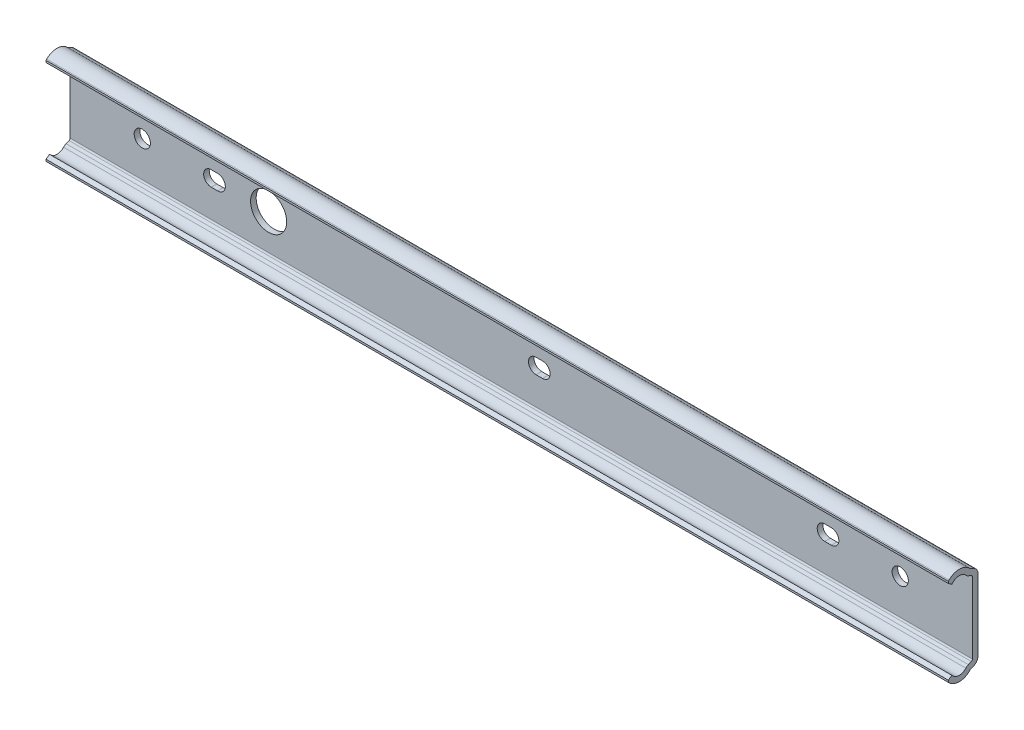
ISO-10303-21;
HEADER;
FILE_DESCRIPTION(('STEP AP214'),'2;1');
FILE_NAME('part.step','',(''),(''),'','','');
FILE_SCHEMA(('AUTOMOTIVE_DESIGN { 1 0 10303 214 1 1 1 1 }'));
ENDSEC;
DATA;
#1=APPLICATION_CONTEXT('core data for automotive mechanical design processes');
#2=APPLICATION_PROTOCOL_DEFINITION('international standard','automotive_design',2000,#1);
#3=PRODUCT_CONTEXT('',#1,'mechanical');
#4=PRODUCT('Part','Part','',(#3));
#5=PRODUCT_RELATED_PRODUCT_CATEGORY('part','',(#4));
#6=PRODUCT_DEFINITION_FORMATION('','',#4);
#7=PRODUCT_DEFINITION_CONTEXT('part definition',#1,'design');
#8=PRODUCT_DEFINITION('design','',#6,#7);
#9=PRODUCT_DEFINITION_SHAPE('','',#8);
#10=(LENGTH_UNIT() NAMED_UNIT(*) SI_UNIT(.MILLI.,.METRE.));
#11=(NAMED_UNIT(*) PLANE_ANGLE_UNIT() SI_UNIT($,.RADIAN.));
#12=(NAMED_UNIT(*) SI_UNIT($,.STERADIAN.) SOLID_ANGLE_UNIT());
#13=UNCERTAINTY_MEASURE_WITH_UNIT(LENGTH_MEASURE(1.E-05),#10,'distance_accuracy_value','');
#14=(GEOMETRIC_REPRESENTATION_CONTEXT(3) GLOBAL_UNCERTAINTY_ASSIGNED_CONTEXT((#13)) GLOBAL_UNIT_ASSIGNED_CONTEXT((#10,
#11,#12)) REPRESENTATION_CONTEXT('',''));
#15=CARTESIAN_POINT('',(0.,0.,0.));
#16=DIRECTION('',(0.,0.,1.));
#17=DIRECTION('',(1.,0.,0.));
#18=AXIS2_PLACEMENT_3D('',#15,#16,#17);
#19=CARTESIAN_POINT('',(-20.,-9.85313472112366,0.));
#20=DIRECTION('',(0.,0.,1.));
#21=DIRECTION('',(1.,0.,0.));
#22=AXIS2_PLACEMENT_3D('',#19,#20,#21);
#23=PLANE('',#22);
#24=DIRECTION('',(-1.,0.,0.));
#25=VECTOR('',#24,1.);
#26=CARTESIAN_POINT('',(-20.,2.09999999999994,0.));
#27=LINE('',#26,#25);
#28=CARTESIAN_POINT('',(110.9,2.1,0.));
#29=VERTEX_POINT('',#28);
#30=CARTESIAN_POINT('',(109.1,2.1,0.));
#31=VERTEX_POINT('',#30);
#32=EDGE_CURVE('E324',#29,#31,#27,.T.);
#33=ORIENTED_EDGE('',*,*,#32,.T.);
#34=CARTESIAN_POINT('',(109.1,0.,0.));
#35=DIRECTION('',(0.,0.,1.));
#36=DIRECTION('',(1.,0.,0.));
#37=AXIS2_PLACEMENT_3D('',#34,#35,#36);
#38=CIRCLE('',#37,2.1);
#39=CARTESIAN_POINT('',(109.1,-2.1,0.));
#40=VERTEX_POINT('',#39);
#41=EDGE_CURVE('E327',#31,#40,#38,.T.);
#42=ORIENTED_EDGE('',*,*,#41,.T.);
#43=DIRECTION('',(1.,0.,0.));
#44=VECTOR('',#43,1.);
#45=CARTESIAN_POINT('',(-20.,-2.10000000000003,0.));
#46=LINE('',#45,#44);
#47=CARTESIAN_POINT('',(110.9,-2.1,0.));
#48=VERTEX_POINT('',#47);
#49=EDGE_CURVE('E321',#40,#48,#46,.T.);
#50=ORIENTED_EDGE('',*,*,#49,.T.);
#51=CARTESIAN_POINT('',(110.9,0.,0.));
#52=DIRECTION('',(0.,0.,1.));
#53=DIRECTION('',(1.,0.,0.));
#54=AXIS2_PLACEMENT_3D('',#51,#52,#53);
#55=CIRCLE('',#54,2.1);
#56=EDGE_CURVE('E265',#48,#29,#55,.T.);
#57=ORIENTED_EDGE('',*,*,#56,.T.);
#58=EDGE_LOOP('',(#33,#42,#50,#57));
#59=FACE_BOUND('',#58,.T.);
#60=DIRECTION('',(-1.,0.,0.));
#61=VECTOR('',#60,1.);
#62=CARTESIAN_POINT('',(-20.,2.0999999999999,0.));
#63=LINE('',#62,#61);
#64=CARTESIAN_POINT('',(190.9,2.1,0.));
#65=VERTEX_POINT('',#64);
#66=CARTESIAN_POINT('',(189.1,2.1,0.));
#67=VERTEX_POINT('',#66);
#68=EDGE_CURVE('E315',#65,#67,#63,.T.);
#69=ORIENTED_EDGE('',*,*,#68,.T.);
#70=CARTESIAN_POINT('',(189.1,0.,0.));
#71=DIRECTION('',(0.,0.,1.));
#72=DIRECTION('',(1.,0.,0.));
#73=AXIS2_PLACEMENT_3D('',#70,#71,#72);
#74=CIRCLE('',#73,2.1);
#75=CARTESIAN_POINT('',(189.1,-2.1,0.));
#76=VERTEX_POINT('',#75);
#77=EDGE_CURVE('E318',#67,#76,#74,.T.);
#78=ORIENTED_EDGE('',*,*,#77,.T.);
#79=DIRECTION('',(1.,0.,0.));
#80=VECTOR('',#79,1.);
#81=CARTESIAN_POINT('',(-20.,-2.10000000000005,0.));
#82=LINE('',#81,#80);
#83=CARTESIAN_POINT('',(190.9,-2.1,0.));
#84=VERTEX_POINT('',#83);
#85=EDGE_CURVE('E289',#76,#84,#82,.T.);
#86=ORIENTED_EDGE('',*,*,#85,.T.);
#87=CARTESIAN_POINT('',(190.9,0.,0.));
#88=DIRECTION('',(0.,0.,1.));
#89=DIRECTION('',(1.,0.,0.));
#90=AXIS2_PLACEMENT_3D('',#87,#88,#89);
#91=CIRCLE('',#90,2.1);
#92=EDGE_CURVE('E312',#84,#65,#91,.T.);
#93=ORIENTED_EDGE('',*,*,#92,.T.);
#94=EDGE_LOOP('',(#69,#78,#86,#93));
#95=FACE_BOUND('',#94,.T.);
#96=DIRECTION('',(1.,0.,0.));
#97=VECTOR('',#96,1.);
#98=CARTESIAN_POINT('',(-20.,-9.85313472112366,0.));
#99=LINE('',#98,#97);
#100=CARTESIAN_POINT('',(-20.,-9.85313472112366,0.));
#101=VERTEX_POINT('',#100);
#102=CARTESIAN_POINT('',(230.,-9.85313472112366,0.));
#103=VERTEX_POINT('',#102);
#104=EDGE_CURVE('E515',#101,#103,#99,.T.);
#105=ORIENTED_EDGE('',*,*,#104,.F.);
#106=DIRECTION('',(0.,-1.,0.));
#107=VECTOR('',#106,1.);
#108=CARTESIAN_POINT('',(-20.,-9.85313472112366,0.));
#109=LINE('',#108,#107);
#110=CARTESIAN_POINT('',(-20.,9.85313427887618,0.));
#111=VERTEX_POINT('',#110);
#112=EDGE_CURVE('E433',#111,#101,#109,.T.);
#113=ORIENTED_EDGE('',*,*,#112,.F.);
#114=DIRECTION('',(1.,0.,0.));
#115=VECTOR('',#114,1.);
#116=CARTESIAN_POINT('',(-20.,9.85313427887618,0.));
#117=LINE('',#116,#115);
#118=CARTESIAN_POINT('',(230.,9.85313427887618,0.));
#119=VERTEX_POINT('',#118);
#120=EDGE_CURVE('E518',#111,#119,#117,.T.);
#121=ORIENTED_EDGE('',*,*,#120,.T.);
#122=DIRECTION('',(0.,-1.,0.));
#123=VECTOR('',#122,1.);
#124=CARTESIAN_POINT('',(230.,-9.85313472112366,0.));
#125=LINE('',#124,#123);
#126=EDGE_CURVE('E380',#119,#103,#125,.T.);
#127=ORIENTED_EDGE('',*,*,#126,.T.);
#128=EDGE_LOOP('',(#105,#113,#121,#127));
#129=FACE_BOUND('',#128,.T.);
#130=CARTESIAN_POINT('',(35.,0.,0.));
#131=DIRECTION('',(0.,0.,-1.));
#132=DIRECTION('',(-1.,0.,0.));
#133=AXIS2_PLACEMENT_3D('',#130,#131,#132);
#134=CIRCLE('',#133,5.);
#135=CARTESIAN_POINT('',(30.,0.,0.));
#136=VERTEX_POINT('',#135);
#137=EDGE_CURVE('E330',#136,#136,#134,.T.);
#138=ORIENTED_EDGE('',*,*,#137,.F.);
#139=EDGE_LOOP('',(#138));
#140=FACE_BOUND('',#139,.T.);
#141=DIRECTION('',(-1.,0.,0.));
#142=VECTOR('',#141,1.);
#143=CARTESIAN_POINT('',(20.9,-2.1,0.));
#144=LINE('',#143,#142);
#145=CARTESIAN_POINT('',(20.9,-2.1,0.));
#146=VERTEX_POINT('',#145);
#147=CARTESIAN_POINT('',(19.1,-2.1,0.));
#148=VERTEX_POINT('',#147);
#149=EDGE_CURVE('E335',#146,#148,#144,.T.);
#150=ORIENTED_EDGE('',*,*,#149,.F.);
#151=CARTESIAN_POINT('',(20.9,0.,0.));
#152=DIRECTION('',(0.,0.,-1.));
#153=DIRECTION('',(-1.,0.,0.));
#154=AXIS2_PLACEMENT_3D('',#151,#152,#153);
#155=CIRCLE('',#154,2.1);
#156=CARTESIAN_POINT('',(20.9,2.1,0.));
#157=VERTEX_POINT('',#156);
#158=EDGE_CURVE('E333',#157,#146,#155,.T.);
#159=ORIENTED_EDGE('',*,*,#158,.F.);
#160=DIRECTION('',(1.,0.,0.));
#161=VECTOR('',#160,1.);
#162=CARTESIAN_POINT('',(20.9,2.1,0.));
#163=LINE('',#162,#161);
#164=CARTESIAN_POINT('',(19.1,2.1,0.));
#165=VERTEX_POINT('',#164);
#166=EDGE_CURVE('E341',#165,#157,#163,.T.);
#167=ORIENTED_EDGE('',*,*,#166,.F.);
#168=CARTESIAN_POINT('',(19.1,0.,0.));
#169=DIRECTION('',(0.,0.,-1.));
#170=DIRECTION('',(-1.,0.,0.));
#171=AXIS2_PLACEMENT_3D('',#168,#169,#170);
#172=CIRCLE('',#171,2.1);
#173=EDGE_CURVE('E338',#148,#165,#172,.T.);
#174=ORIENTED_EDGE('',*,*,#173,.F.);
#175=EDGE_LOOP('',(#150,#159,#167,#174));
#176=FACE_BOUND('',#175,.T.);
#177=CARTESIAN_POINT('',(0.,0.,0.));
#178=DIRECTION('',(0.,0.,-1.));
#179=DIRECTION('',(-1.,0.,0.));
#180=AXIS2_PLACEMENT_3D('',#177,#178,#179);
#181=CIRCLE('',#180,2.24999999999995);
#182=CARTESIAN_POINT('',(-2.24999999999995,0.,0.));
#183=VERTEX_POINT('',#182);
#184=EDGE_CURVE('E347',#183,#183,#181,.T.);
#185=ORIENTED_EDGE('',*,*,#184,.F.);
#186=EDGE_LOOP('',(#185));
#187=FACE_BOUND('',#186,.T.);
#188=CARTESIAN_POINT('',(210.,0.,0.));
#189=DIRECTION('',(0.,0.,-1.));
#190=DIRECTION('',(-1.,0.,0.));
#191=AXIS2_PLACEMENT_3D('',#188,#189,#190);
#192=CIRCLE('',#191,2.25);
#193=CARTESIAN_POINT('',(207.75,0.,0.));
#194=VERTEX_POINT('',#193);
#195=EDGE_CURVE('E357',#194,#194,#192,.T.);
#196=ORIENTED_EDGE('',*,*,#195,.F.);
#197=EDGE_LOOP('',(#196));
#198=FACE_BOUND('',#197,.T.);
#199=ADVANCED_FACE('F14',(#59,#95,#129,#140,#176,#187,#198),#23,.F.);
#200=CARTESIAN_POINT('',(-20.,-9.85313472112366,1.54999999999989));
#201=DIRECTION('',(0.,0.,-1.));
#202=DIRECTION('',(-1.,0.,0.));
#203=AXIS2_PLACEMENT_3D('',#200,#201,#202);
#204=PLANE('',#203);
#205=DIRECTION('',(1.,0.,0.));
#206=VECTOR('',#205,1.);
#207=CARTESIAN_POINT('',(109.1,-2.1,1.54999999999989));
#208=LINE('',#207,#206);
#209=CARTESIAN_POINT('',(109.1,-2.1,1.54999999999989));
#210=VERTEX_POINT('',#209);
#211=CARTESIAN_POINT('',(110.9,-2.1,1.54999999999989));
#212=VERTEX_POINT('',#211);
#213=EDGE_CURVE('E272',#210,#212,#208,.T.);
#214=ORIENTED_EDGE('',*,*,#213,.F.);
#215=CARTESIAN_POINT('',(109.1,0.,1.54999999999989));
#216=DIRECTION('',(0.,0.,1.));
#217=DIRECTION('',(1.,0.,0.));
#218=AXIS2_PLACEMENT_3D('',#215,#216,#217);
#219=CIRCLE('',#218,2.1);
#220=CARTESIAN_POINT('',(109.1,2.1,1.54999999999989));
#221=VERTEX_POINT('',#220);
#222=EDGE_CURVE('E277',#221,#210,#219,.T.);
#223=ORIENTED_EDGE('',*,*,#222,.F.);
#224=DIRECTION('',(-1.,0.,0.));
#225=VECTOR('',#224,1.);
#226=CARTESIAN_POINT('',(109.1,2.1,1.54999999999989));
#227=LINE('',#226,#225);
#228=CARTESIAN_POINT('',(110.9,2.1,1.54999999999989));
#229=VERTEX_POINT('',#228);
#230=EDGE_CURVE('E282',#229,#221,#227,.T.);
#231=ORIENTED_EDGE('',*,*,#230,.F.);
#232=CARTESIAN_POINT('',(110.9,0.,1.54999999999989));
#233=DIRECTION('',(0.,0.,1.));
#234=DIRECTION('',(1.,0.,0.));
#235=AXIS2_PLACEMENT_3D('',#232,#233,#234);
#236=CIRCLE('',#235,2.1);
#237=EDGE_CURVE('E262',#212,#229,#236,.T.);
#238=ORIENTED_EDGE('',*,*,#237,.F.);
#239=EDGE_LOOP('',(#214,#223,#231,#238));
#240=FACE_BOUND('',#239,.T.);
#241=DIRECTION('',(1.,0.,0.));
#242=VECTOR('',#241,1.);
#243=CARTESIAN_POINT('',(189.1,-2.1,1.54999999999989));
#244=LINE('',#243,#242);
#245=CARTESIAN_POINT('',(189.1,-2.1,1.54999999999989));
#246=VERTEX_POINT('',#245);
#247=CARTESIAN_POINT('',(190.9,-2.1,1.54999999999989));
#248=VERTEX_POINT('',#247);
#249=EDGE_CURVE('E294',#246,#248,#244,.T.);
#250=ORIENTED_EDGE('',*,*,#249,.F.);
#251=CARTESIAN_POINT('',(189.1,0.,1.54999999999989));
#252=DIRECTION('',(0.,0.,1.));
#253=DIRECTION('',(1.,0.,0.));
#254=AXIS2_PLACEMENT_3D('',#251,#252,#253);
#255=CIRCLE('',#254,2.1);
#256=CARTESIAN_POINT('',(189.1,2.1,1.54999999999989));
#257=VERTEX_POINT('',#256);
#258=EDGE_CURVE('E292',#257,#246,#255,.T.);
#259=ORIENTED_EDGE('',*,*,#258,.F.);
#260=DIRECTION('',(-1.,0.,0.));
#261=VECTOR('',#260,1.);
#262=CARTESIAN_POINT('',(189.1,2.1,1.54999999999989));
#263=LINE('',#262,#261);
#264=CARTESIAN_POINT('',(190.9,2.1,1.54999999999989));
#265=VERTEX_POINT('',#264);
#266=EDGE_CURVE('E299',#265,#257,#263,.T.);
#267=ORIENTED_EDGE('',*,*,#266,.F.);
#268=CARTESIAN_POINT('',(190.9,0.,1.54999999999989));
#269=DIRECTION('',(0.,0.,1.));
#270=DIRECTION('',(1.,0.,0.));
#271=AXIS2_PLACEMENT_3D('',#268,#269,#270);
#272=CIRCLE('',#271,2.1);
#273=EDGE_CURVE('E296',#248,#265,#272,.T.);
#274=ORIENTED_EDGE('',*,*,#273,.F.);
#275=EDGE_LOOP('',(#250,#259,#267,#274));
#276=FACE_BOUND('',#275,.T.);
#277=CARTESIAN_POINT('',(35.,0.,1.54999999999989));
#278=DIRECTION('',(0.,0.,-1.));
#279=DIRECTION('',(-1.,0.,0.));
#280=AXIS2_PLACEMENT_3D('',#277,#278,#279);
#281=CIRCLE('',#280,5.);
#282=CARTESIAN_POINT('',(30.,0.,1.54999999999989));
#283=VERTEX_POINT('',#282);
#284=EDGE_CURVE('E18',#283,#283,#281,.T.);
#285=ORIENTED_EDGE('',*,*,#284,.T.);
#286=EDGE_LOOP('',(#285));
#287=FACE_BOUND('',#286,.T.);
#288=DIRECTION('',(1.,0.,0.));
#289=VECTOR('',#288,1.);
#290=CARTESIAN_POINT('',(-20.,2.1,1.54999999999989));
#291=LINE('',#290,#289);
#292=CARTESIAN_POINT('',(19.1,2.1,1.54999999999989));
#293=VERTEX_POINT('',#292);
#294=CARTESIAN_POINT('',(20.9,2.1,1.54999999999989));
#295=VERTEX_POINT('',#294);
#296=EDGE_CURVE('E23',#293,#295,#291,.T.);
#297=ORIENTED_EDGE('',*,*,#296,.T.);
#298=CARTESIAN_POINT('',(20.9,0.,1.54999999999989));
#299=DIRECTION('',(0.,0.,-1.));
#300=DIRECTION('',(-1.,0.,0.));
#301=AXIS2_PLACEMENT_3D('',#298,#299,#300);
#302=CIRCLE('',#301,2.1);
#303=CARTESIAN_POINT('',(20.9,-2.1,1.54999999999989));
#304=VERTEX_POINT('',#303);
#305=EDGE_CURVE('E9',#295,#304,#302,.T.);
#306=ORIENTED_EDGE('',*,*,#305,.T.);
#307=DIRECTION('',(-1.,0.,0.));
#308=VECTOR('',#307,1.);
#309=CARTESIAN_POINT('',(-20.,-2.1,1.54999999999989));
#310=LINE('',#309,#308);
#311=CARTESIAN_POINT('',(19.1,-2.1,1.54999999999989));
#312=VERTEX_POINT('',#311);
#313=EDGE_CURVE('E545',#304,#312,#310,.T.);
#314=ORIENTED_EDGE('',*,*,#313,.T.);
#315=CARTESIAN_POINT('',(19.1,0.,1.54999999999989));
#316=DIRECTION('',(0.,0.,-1.));
#317=DIRECTION('',(-1.,0.,0.));
#318=AXIS2_PLACEMENT_3D('',#315,#316,#317);
#319=CIRCLE('',#318,2.1);
#320=EDGE_CURVE('E552',#312,#293,#319,.T.);
#321=ORIENTED_EDGE('',*,*,#320,.T.);
#322=EDGE_LOOP('',(#297,#306,#314,#321));
#323=FACE_BOUND('',#322,.T.);
#324=CARTESIAN_POINT('',(0.,0.,1.54999999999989));
#325=DIRECTION('',(0.,0.,-1.));
#326=DIRECTION('',(-1.,0.,0.));
#327=AXIS2_PLACEMENT_3D('',#324,#325,#326);
#328=CIRCLE('',#327,2.24999999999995);
#329=CARTESIAN_POINT('',(-2.24999999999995,0.,1.54999999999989));
#330=VERTEX_POINT('',#329);
#331=EDGE_CURVE('E356',#330,#330,#328,.T.);
#332=ORIENTED_EDGE('',*,*,#331,.T.);
#333=EDGE_LOOP('',(#332));
#334=FACE_BOUND('',#333,.T.);
#335=CARTESIAN_POINT('',(210.,0.,1.54999999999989));
#336=DIRECTION('',(0.,0.,-1.));
#337=DIRECTION('',(-1.,0.,0.));
#338=AXIS2_PLACEMENT_3D('',#335,#336,#337);
#339=CIRCLE('',#338,2.25);
#340=CARTESIAN_POINT('',(207.75,0.,1.54999999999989));
#341=VERTEX_POINT('',#340);
#342=EDGE_CURVE('E360',#341,#341,#339,.T.);
#343=ORIENTED_EDGE('',*,*,#342,.T.);
#344=EDGE_LOOP('',(#343));
#345=FACE_BOUND('',#344,.T.);
#346=DIRECTION('',(1.,0.,0.));
#347=VECTOR('',#346,1.);
#348=CARTESIAN_POINT('',(-20.,9.85313427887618,1.54999999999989));
#349=LINE('',#348,#347);
#350=CARTESIAN_POINT('',(-20.,9.85313427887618,1.54999999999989));
#351=VERTEX_POINT('',#350);
#352=CARTESIAN_POINT('',(230.,9.85313427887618,1.54999999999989));
#353=VERTEX_POINT('',#352);
#354=EDGE_CURVE('E476',#351,#353,#349,.T.);
#355=ORIENTED_EDGE('',*,*,#354,.F.);
#356=DIRECTION('',(0.,1.,0.));
#357=VECTOR('',#356,1.);
#358=CARTESIAN_POINT('',(-20.,-9.85313472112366,1.54999999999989));
#359=LINE('',#358,#357);
#360=CARTESIAN_POINT('',(-20.,-9.85313472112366,1.54999999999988));
#361=VERTEX_POINT('',#360);
#362=EDGE_CURVE('E459',#361,#351,#359,.T.);
#363=ORIENTED_EDGE('',*,*,#362,.F.);
#364=DIRECTION('',(1.,0.,0.));
#365=VECTOR('',#364,1.);
#366=CARTESIAN_POINT('',(-20.,-9.85313472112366,1.54999999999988));
#367=LINE('',#366,#365);
#368=CARTESIAN_POINT('',(230.,-9.85313472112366,1.54999999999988));
#369=VERTEX_POINT('',#368);
#370=EDGE_CURVE('E479',#361,#369,#367,.T.);
#371=ORIENTED_EDGE('',*,*,#370,.T.);
#372=DIRECTION('',(0.,1.,0.));
#373=VECTOR('',#372,1.);
#374=CARTESIAN_POINT('',(230.,-9.85313472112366,1.54999999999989));
#375=LINE('',#374,#373);
#376=EDGE_CURVE('E406',#369,#353,#375,.T.);
#377=ORIENTED_EDGE('',*,*,#376,.T.);
#378=EDGE_LOOP('',(#355,#363,#371,#377));
#379=FACE_BOUND('',#378,.T.);
#380=ADVANCED_FACE('F279',(#240,#276,#287,#323,#334,#345,#379),#204,.F.);
#381=CARTESIAN_POINT('',(-20.,9.47,5.19000063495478));
#382=DIRECTION('',(-1.,0.,0.));
#383=DIRECTION('',(0.,0.,1.));
#384=AXIS2_PLACEMENT_3D('',#381,#382,#383);
#385=PLANE('',#384);
#386=ORIENTED_EDGE('',*,*,#362,.T.);
#387=CARTESIAN_POINT('',(-20.,9.85313427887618,2.05000034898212));
#388=DIRECTION('',(1.,0.,0.));
#389=DIRECTION('',(0.,0.,1.));
#390=AXIS2_PLACEMENT_3D('',#387,#388,#389);
#391=CIRCLE('',#390,0.500000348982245);
#392=CARTESIAN_POINT('',(-20.,10.3133869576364,1.85463448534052));
#393=VERTEX_POINT('',#392);
#394=EDGE_CURVE('E461',#351,#393,#391,.T.);
#395=ORIENTED_EDGE('',*,*,#394,.T.);
#396=DIRECTION('',(0.,0.39073096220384,0.920504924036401));
#397=VECTOR('',#396,1.);
#398=CARTESIAN_POINT('',(-20.,10.6566650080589,2.66334729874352));
#399=LINE('',#398,#397);
#400=CARTESIAN_POINT('',(-20.,10.6566650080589,2.66334729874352));
#401=VERTEX_POINT('',#400);
#402=EDGE_CURVE('E463',#393,#401,#399,.T.);
#403=ORIENTED_EDGE('',*,*,#402,.T.);
#404=CARTESIAN_POINT('',(-20.,12.5437002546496,1.86234835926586));
#405=DIRECTION('',(-1.,0.,0.));
#406=DIRECTION('',(0.,0.,1.));
#407=AXIS2_PLACEMENT_3D('',#404,#405,#406);
#408=CIRCLE('',#407,2.05000032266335);
#409=CARTESIAN_POINT('',(-20.,11.152732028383,3.36823969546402));
#410=VERTEX_POINT('',#409);
#411=EDGE_CURVE('E465',#401,#410,#408,.T.);
#412=ORIENTED_EDGE('',*,*,#411,.T.);
#413=CARTESIAN_POINT('',(-20.,9.47,5.19000063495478));
#414=DIRECTION('',(1.,0.,0.));
#415=DIRECTION('',(0.,0.,1.));
#416=AXIS2_PLACEMENT_3D('',#413,#414,#415);
#417=CIRCLE('',#416,2.48);
#418=CARTESIAN_POINT('',(-20.,11.2236248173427,6.94362545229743));
#419=VERTEX_POINT('',#418);
#420=EDGE_CURVE('E414',#410,#419,#417,.T.);
#421=ORIENTED_EDGE('',*,*,#420,.T.);
#422=DIRECTION('',(0.,-0.707107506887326,0.707106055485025));
#423=VECTOR('',#422,1.);
#424=CARTESIAN_POINT('',(-20.,11.2236248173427,6.94362545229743));
#425=LINE('',#424,#423);
#426=CARTESIAN_POINT('',(-20.,10.9144130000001,7.2528366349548));
#427=VERTEX_POINT('',#426);
#428=EDGE_CURVE('E417',#419,#427,#425,.T.);
#429=ORIENTED_EDGE('',*,*,#428,.T.);
#430=DIRECTION('',(0.,0.573576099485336,0.819152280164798));
#431=VECTOR('',#430,1.);
#432=CARTESIAN_POINT('',(-20.,10.9144130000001,7.2528366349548));
#433=LINE('',#432,#431);
#434=CARTESIAN_POINT('',(-20.,11.59863,8.23000063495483));
#435=VERTEX_POINT('',#434);
#436=EDGE_CURVE('E419',#427,#435,#433,.T.);
#437=ORIENTED_EDGE('',*,*,#436,.T.);
#438=DIRECTION('',(0.,1.,-2.09219452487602E-13));
#439=VECTOR('',#438,1.);
#440=CARTESIAN_POINT('',(-20.,12.12928,8.23000063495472));
#441=LINE('',#440,#439);
#442=CARTESIAN_POINT('',(-20.,12.12928,8.23000063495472));
#443=VERTEX_POINT('',#442);
#444=EDGE_CURVE('E421',#435,#443,#441,.T.);
#445=ORIENTED_EDGE('',*,*,#444,.T.);
#446=DIRECTION('',(0.,0.707108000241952,-0.707105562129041));
#447=VECTOR('',#446,1.);
#448=CARTESIAN_POINT('',(-20.,12.3196403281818,8.03964096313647));
#449=LINE('',#448,#447);
#450=CARTESIAN_POINT('',(-20.,12.3196403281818,8.03964096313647));
#451=VERTEX_POINT('',#450);
#452=EDGE_CURVE('E423',#443,#451,#449,.T.);
#453=ORIENTED_EDGE('',*,*,#452,.T.);
#454=CARTESIAN_POINT('',(-20.,9.47,5.19000063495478));
#455=DIRECTION('',(-1.,0.,0.));
#456=DIRECTION('',(0.,0.,1.));
#457=AXIS2_PLACEMENT_3D('',#454,#455,#456);
#458=CIRCLE('',#457,4.02999999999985);
#459=CARTESIAN_POINT('',(-20.,12.2044395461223,2.22963910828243));
#460=VERTEX_POINT('',#459);
#461=EDGE_CURVE('E425',#451,#460,#458,.T.);
#462=ORIENTED_EDGE('',*,*,#461,.T.);
#463=CARTESIAN_POINT('',(-20.,12.5437002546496,1.86234835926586));
#464=DIRECTION('',(1.,0.,0.));
#465=DIRECTION('',(0.,0.,1.));
#466=AXIS2_PLACEMENT_3D('',#463,#464,#465);
#467=CIRCLE('',#466,0.500000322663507);
#468=CARTESIAN_POINT('',(-20.,12.0834476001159,2.05771421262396));
#469=VERTEX_POINT('',#468);
#470=EDGE_CURVE('E427',#460,#469,#467,.T.);
#471=ORIENTED_EDGE('',*,*,#470,.T.);
#472=DIRECTION('',(0.,-0.39073096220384,-0.920504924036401));
#473=VECTOR('',#472,1.);
#474=CARTESIAN_POINT('',(-20.,12.0834476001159,2.05771421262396));
#475=LINE('',#474,#473);
#476=CARTESIAN_POINT('',(-20.,11.7401695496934,1.24900139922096));
#477=VERTEX_POINT('',#476);
#478=EDGE_CURVE('E429',#469,#477,#475,.T.);
#479=ORIENTED_EDGE('',*,*,#478,.T.);
#480=CARTESIAN_POINT('',(-20.,9.85313427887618,2.05000034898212));
#481=DIRECTION('',(-1.,0.,0.));
#482=DIRECTION('',(0.,0.,1.));
#483=AXIS2_PLACEMENT_3D('',#480,#481,#482);
#484=CIRCLE('',#483,2.05000034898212);
#485=EDGE_CURVE('E431',#477,#111,#484,.T.);
#486=ORIENTED_EDGE('',*,*,#485,.T.);
#487=ORIENTED_EDGE('',*,*,#112,.T.);
#488=CARTESIAN_POINT('',(-20.,-9.85313472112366,2.05000034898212));
#489=DIRECTION('',(-1.,0.,0.));
#490=DIRECTION('',(0.,0.,-1.));
#491=AXIS2_PLACEMENT_3D('',#488,#489,#490);
#492=CIRCLE('',#491,2.05000034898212);
#493=CARTESIAN_POINT('',(-20.,-11.7401699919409,1.24900139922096));
#494=VERTEX_POINT('',#493);
#495=EDGE_CURVE('E435',#101,#494,#492,.T.);
#496=ORIENTED_EDGE('',*,*,#495,.T.);
#497=DIRECTION('',(0.,-0.39073096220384,0.920504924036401));
#498=VECTOR('',#497,1.);
#499=CARTESIAN_POINT('',(-20.,-12.0834480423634,2.05771421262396));
#500=LINE('',#499,#498);
#501=CARTESIAN_POINT('',(-20.,-12.0834480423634,2.05771421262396));
#502=VERTEX_POINT('',#501);
#503=EDGE_CURVE('E437',#494,#502,#500,.T.);
#504=ORIENTED_EDGE('',*,*,#503,.T.);
#505=CARTESIAN_POINT('',(-20.,-12.543700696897,1.86234835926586));
#506=DIRECTION('',(1.,0.,0.));
#507=DIRECTION('',(0.,0.,-1.));
#508=AXIS2_PLACEMENT_3D('',#505,#506,#507);
#509=CIRCLE('',#508,0.500000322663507);
#510=CARTESIAN_POINT('',(-20.,-12.2044399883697,2.22963910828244));
#511=VERTEX_POINT('',#510);
#512=EDGE_CURVE('E439',#502,#511,#509,.T.);
#513=ORIENTED_EDGE('',*,*,#512,.T.);
#514=CARTESIAN_POINT('',(-20.,-9.47000044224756,5.19000063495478));
#515=DIRECTION('',(-1.,0.,0.));
#516=DIRECTION('',(0.,0.,-1.));
#517=AXIS2_PLACEMENT_3D('',#514,#515,#516);
#518=CIRCLE('',#517,4.02999999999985);
#519=CARTESIAN_POINT('',(-20.,-12.3196407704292,8.03964096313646));
#520=VERTEX_POINT('',#519);
#521=EDGE_CURVE('E441',#511,#520,#518,.T.);
#522=ORIENTED_EDGE('',*,*,#521,.T.);
#523=DIRECTION('',(0.,0.707108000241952,0.707105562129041));
#524=VECTOR('',#523,1.);
#525=CARTESIAN_POINT('',(-20.,-12.3196407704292,8.03964096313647));
#526=LINE('',#525,#524);
#527=CARTESIAN_POINT('',(-20.,-12.1292804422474,8.23000063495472));
#528=VERTEX_POINT('',#527);
#529=EDGE_CURVE('E443',#520,#528,#526,.T.);
#530=ORIENTED_EDGE('',*,*,#529,.T.);
#531=DIRECTION('',(0.,1.,2.09219452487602E-13));
#532=VECTOR('',#531,1.);
#533=CARTESIAN_POINT('',(-20.,-12.1292804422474,8.23000063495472));
#534=LINE('',#533,#532);
#535=CARTESIAN_POINT('',(-20.,-11.5986304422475,8.23000063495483));
#536=VERTEX_POINT('',#535);
#537=EDGE_CURVE('E445',#528,#536,#534,.T.);
#538=ORIENTED_EDGE('',*,*,#537,.T.);
#539=DIRECTION('',(0.,0.573576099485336,-0.819152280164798));
#540=VECTOR('',#539,1.);
#541=CARTESIAN_POINT('',(-20.,-10.9144134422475,7.2528366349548));
#542=LINE('',#541,#540);
#543=CARTESIAN_POINT('',(-20.,-10.9144134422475,7.2528366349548));
#544=VERTEX_POINT('',#543);
#545=EDGE_CURVE('E447',#536,#544,#542,.T.);
#546=ORIENTED_EDGE('',*,*,#545,.T.);
#547=DIRECTION('',(0.,-0.707107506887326,-0.707106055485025));
#548=VECTOR('',#547,1.);
#549=CARTESIAN_POINT('',(-20.,-11.2236252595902,6.94362545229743));
#550=LINE('',#549,#548);
#551=CARTESIAN_POINT('',(-20.,-11.2236252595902,6.94362545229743));
#552=VERTEX_POINT('',#551);
#553=EDGE_CURVE('E449',#544,#552,#550,.T.);
#554=ORIENTED_EDGE('',*,*,#553,.T.);
#555=CARTESIAN_POINT('',(-20.,-9.47000044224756,5.19000063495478));
#556=DIRECTION('',(1.,0.,0.));
#557=DIRECTION('',(0.,0.,-1.));
#558=AXIS2_PLACEMENT_3D('',#555,#556,#557);
#559=CIRCLE('',#558,2.48);
#560=CARTESIAN_POINT('',(-20.,-11.1527324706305,3.36823969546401));
#561=VERTEX_POINT('',#560);
#562=EDGE_CURVE('E451',#552,#561,#559,.T.);
#563=ORIENTED_EDGE('',*,*,#562,.T.);
#564=CARTESIAN_POINT('',(-20.,-12.543700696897,1.86234835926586));
#565=DIRECTION('',(-1.,0.,0.));
#566=DIRECTION('',(0.,0.,-1.));
#567=AXIS2_PLACEMENT_3D('',#564,#565,#566);
#568=CIRCLE('',#567,2.05000032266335);
#569=CARTESIAN_POINT('',(-20.,-10.6566654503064,2.66334729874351));
#570=VERTEX_POINT('',#569);
#571=EDGE_CURVE('E453',#561,#570,#568,.T.);
#572=ORIENTED_EDGE('',*,*,#571,.T.);
#573=DIRECTION('',(0.,0.39073096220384,-0.920504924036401));
#574=VECTOR('',#573,1.);
#575=CARTESIAN_POINT('',(-20.,-10.6566654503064,2.66334729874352));
#576=LINE('',#575,#574);
#577=CARTESIAN_POINT('',(-20.,-10.3133873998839,1.85463448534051));
#578=VERTEX_POINT('',#577);
#579=EDGE_CURVE('E455',#570,#578,#576,.T.);
#580=ORIENTED_EDGE('',*,*,#579,.T.);
#581=CARTESIAN_POINT('',(-20.,-9.85313472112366,2.05000034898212));
#582=DIRECTION('',(1.,0.,0.));
#583=DIRECTION('',(0.,0.,-1.));
#584=AXIS2_PLACEMENT_3D('',#581,#582,#583);
#585=CIRCLE('',#584,0.500000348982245);
#586=EDGE_CURVE('E457',#578,#361,#585,.T.);
#587=ORIENTED_EDGE('',*,*,#586,.T.);
#588=EDGE_LOOP('',(#386,#395,#403,#412,#421,#429,#437,#445,#453,#462,#471,#479,#486,#487,#496,
#504,#513,#522,#530,#538,#546,#554,#563,#572,#580,#587));
#589=FACE_BOUND('',#588,.T.);
#590=ADVANCED_FACE('F595',(#589),#385,.T.);
#591=CARTESIAN_POINT('',(-20.,9.47,5.19000063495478));
#592=DIRECTION('',(1.,0.,0.));
#593=DIRECTION('',(0.,0.,-1.));
#594=AXIS2_PLACEMENT_3D('',#591,#592,#593);
#595=CYLINDRICAL_SURFACE('',#594,2.48);
#596=CARTESIAN_POINT('',(230.,9.47,5.19000063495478));
#597=DIRECTION('',(1.,0.,0.));
#598=DIRECTION('',(0.,0.,1.));
#599=AXIS2_PLACEMENT_3D('',#596,#597,#598);
#600=CIRCLE('',#599,2.48);
#601=CARTESIAN_POINT('',(230.,11.152732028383,3.36823969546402));
#602=VERTEX_POINT('',#601);
#603=CARTESIAN_POINT('',(230.,11.2236248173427,6.94362545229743));
#604=VERTEX_POINT('',#603);
#605=EDGE_CURVE('E361',#602,#604,#600,.T.);
#606=ORIENTED_EDGE('',*,*,#605,.T.);
#607=DIRECTION('',(1.,0.,0.));
#608=VECTOR('',#607,1.);
#609=CARTESIAN_POINT('',(-20.,11.2236248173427,6.94362545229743));
#610=LINE('',#609,#608);
#611=EDGE_CURVE('E542',#419,#604,#610,.T.);
#612=ORIENTED_EDGE('',*,*,#611,.F.);
#613=ORIENTED_EDGE('',*,*,#420,.F.);
#614=DIRECTION('',(1.,0.,0.));
#615=VECTOR('',#614,1.);
#616=CARTESIAN_POINT('',(-20.,11.152732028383,3.36823969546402));
#617=LINE('',#616,#615);
#618=EDGE_CURVE('E467',#410,#602,#617,.T.);
#619=ORIENTED_EDGE('',*,*,#618,.T.);
#620=EDGE_LOOP('',(#606,#612,#613,#619));
#621=FACE_BOUND('',#620,.T.);
#622=ADVANCED_FACE('F16',(#621),#595,.F.);
#623=CARTESIAN_POINT('',(-20.,11.2236248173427,6.94362545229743));
#624=DIRECTION('',(0.,0.707106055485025,0.707107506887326));
#625=DIRECTION('',(0.,0.707107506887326,-0.707106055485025));
#626=AXIS2_PLACEMENT_3D('',#623,#624,#625);
#627=PLANE('',#626);
#628=DIRECTION('',(0.,-0.707107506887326,0.707106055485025));
#629=VECTOR('',#628,1.);
#630=CARTESIAN_POINT('',(230.,11.2236248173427,6.94362545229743));
#631=LINE('',#630,#629);
#632=CARTESIAN_POINT('',(230.,10.9144130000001,7.2528366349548));
#633=VERTEX_POINT('',#632);
#634=EDGE_CURVE('E364',#604,#633,#631,.T.);
#635=ORIENTED_EDGE('',*,*,#634,.T.);
#636=DIRECTION('',(1.,0.,0.));
#637=VECTOR('',#636,1.);
#638=CARTESIAN_POINT('',(-20.,10.9144130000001,7.2528366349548));
#639=LINE('',#638,#637);
#640=EDGE_CURVE('E539',#427,#633,#639,.T.);
#641=ORIENTED_EDGE('',*,*,#640,.F.);
#642=ORIENTED_EDGE('',*,*,#428,.F.);
#643=ORIENTED_EDGE('',*,*,#611,.T.);
#644=EDGE_LOOP('',(#635,#641,#642,#643));
#645=FACE_BOUND('',#644,.T.);
#646=ADVANCED_FACE('F628',(#645),#627,.F.);
#647=CARTESIAN_POINT('',(-20.,10.9144130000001,7.2528366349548));
#648=DIRECTION('',(0.,0.819152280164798,-0.573576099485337));
#649=DIRECTION('',(0.,-0.573576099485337,-0.819152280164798));
#650=AXIS2_PLACEMENT_3D('',#647,#648,#649);
#651=PLANE('',#650);
#652=DIRECTION('',(0.,0.573576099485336,0.819152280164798));
#653=VECTOR('',#652,1.);
#654=CARTESIAN_POINT('',(230.,10.9144130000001,7.2528366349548));
#655=LINE('',#654,#653);
#656=CARTESIAN_POINT('',(230.,11.59863,8.23000063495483));
#657=VERTEX_POINT('',#656);
#658=EDGE_CURVE('E366',#633,#657,#655,.T.);
#659=ORIENTED_EDGE('',*,*,#658,.T.);
#660=DIRECTION('',(1.,0.,0.));
#661=VECTOR('',#660,1.);
#662=CARTESIAN_POINT('',(-20.,11.59863,8.23000063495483));
#663=LINE('',#662,#661);
#664=EDGE_CURVE('E536',#435,#657,#663,.T.);
#665=ORIENTED_EDGE('',*,*,#664,.F.);
#666=ORIENTED_EDGE('',*,*,#436,.F.);
#667=ORIENTED_EDGE('',*,*,#640,.T.);
#668=EDGE_LOOP('',(#659,#665,#666,#667));
#669=FACE_BOUND('',#668,.T.);
#670=ADVANCED_FACE('F625',(#669),#651,.F.);
#671=CARTESIAN_POINT('',(-20.,12.12928,8.23000063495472));
#672=DIRECTION('',(0.,-2.09219452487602E-13,-1.));
#673=DIRECTION('',(0.,-1.,2.09219452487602E-13));
#674=AXIS2_PLACEMENT_3D('',#671,#672,#673);
#675=PLANE('',#674);
#676=DIRECTION('',(0.,1.,-2.09219452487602E-13));
#677=VECTOR('',#676,1.);
#678=CARTESIAN_POINT('',(230.,12.12928,8.23000063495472));
#679=LINE('',#678,#677);
#680=CARTESIAN_POINT('',(230.,12.12928,8.23000063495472));
#681=VERTEX_POINT('',#680);
#682=EDGE_CURVE('E368',#657,#681,#679,.T.);
#683=ORIENTED_EDGE('',*,*,#682,.T.);
#684=DIRECTION('',(1.,0.,0.));
#685=VECTOR('',#684,1.);
#686=CARTESIAN_POINT('',(-20.,12.12928,8.23000063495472));
#687=LINE('',#686,#685);
#688=EDGE_CURVE('E533',#443,#681,#687,.T.);
#689=ORIENTED_EDGE('',*,*,#688,.F.);
#690=ORIENTED_EDGE('',*,*,#444,.F.);
#691=ORIENTED_EDGE('',*,*,#664,.T.);
#692=EDGE_LOOP('',(#683,#689,#690,#691));
#693=FACE_BOUND('',#692,.T.);
#694=ADVANCED_FACE('F621',(#693),#675,.F.);
#695=CARTESIAN_POINT('',(-20.,12.3196403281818,8.03964096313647));
#696=DIRECTION('',(0.,-0.707105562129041,-0.707108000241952));
#697=DIRECTION('',(0.,-0.707108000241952,0.707105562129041));
#698=AXIS2_PLACEMENT_3D('',#695,#696,#697);
#699=PLANE('',#698);
#700=DIRECTION('',(0.,0.707108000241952,-0.707105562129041));
#701=VECTOR('',#700,1.);
#702=CARTESIAN_POINT('',(230.,12.3196403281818,8.03964096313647));
#703=LINE('',#702,#701);
#704=CARTESIAN_POINT('',(230.,12.3196403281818,8.03964096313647));
#705=VERTEX_POINT('',#704);
#706=EDGE_CURVE('E370',#681,#705,#703,.T.);
#707=ORIENTED_EDGE('',*,*,#706,.T.);
#708=DIRECTION('',(1.,0.,0.));
#709=VECTOR('',#708,1.);
#710=CARTESIAN_POINT('',(-20.,12.3196403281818,8.03964096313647));
#711=LINE('',#710,#709);
#712=EDGE_CURVE('E530',#451,#705,#711,.T.);
#713=ORIENTED_EDGE('',*,*,#712,.F.);
#714=ORIENTED_EDGE('',*,*,#452,.F.);
#715=ORIENTED_EDGE('',*,*,#688,.T.);
#716=EDGE_LOOP('',(#707,#713,#714,#715));
#717=FACE_BOUND('',#716,.T.);
#718=ADVANCED_FACE('F617',(#717),#699,.F.);
#719=CARTESIAN_POINT('',(-20.,9.47,5.19000063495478));
#720=DIRECTION('',(1.,0.,0.));
#721=DIRECTION('',(0.,0.,-1.));
#722=AXIS2_PLACEMENT_3D('',#719,#720,#721);
#723=CYLINDRICAL_SURFACE('',#722,4.02999999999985);
#724=DIRECTION('',(1.,0.,0.));
#725=VECTOR('',#724,1.);
#726=CARTESIAN_POINT('',(-20.,12.2044395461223,2.22963910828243));
#727=LINE('',#726,#725);
#728=CARTESIAN_POINT('',(230.,12.2044395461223,2.22963910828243));
#729=VERTEX_POINT('',#728);
#730=EDGE_CURVE('E527',#460,#729,#727,.T.);
#731=ORIENTED_EDGE('',*,*,#730,.F.);
#732=ORIENTED_EDGE('',*,*,#461,.F.);
#733=ORIENTED_EDGE('',*,*,#712,.T.);
#734=CARTESIAN_POINT('',(230.,9.47,5.19000063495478));
#735=DIRECTION('',(-1.,0.,0.));
#736=DIRECTION('',(0.,0.,1.));
#737=AXIS2_PLACEMENT_3D('',#734,#735,#736);
#738=CIRCLE('',#737,4.02999999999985);
#739=EDGE_CURVE('E372',#705,#729,#738,.T.);
#740=ORIENTED_EDGE('',*,*,#739,.T.);
#741=EDGE_LOOP('',(#731,#732,#733,#740));
#742=FACE_BOUND('',#741,.T.);
#743=ADVANCED_FACE('F613',(#742),#723,.T.);
#744=CARTESIAN_POINT('',(-20.,12.5437002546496,1.86234835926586));
#745=DIRECTION('',(1.,0.,0.));
#746=DIRECTION('',(0.,0.,-1.));
#747=AXIS2_PLACEMENT_3D('',#744,#745,#746);
#748=CYLINDRICAL_SURFACE('',#747,0.500000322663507);
#749=CARTESIAN_POINT('',(230.,12.5437002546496,1.86234835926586));
#750=DIRECTION('',(1.,0.,0.));
#751=DIRECTION('',(0.,0.,1.));
#752=AXIS2_PLACEMENT_3D('',#749,#750,#751);
#753=CIRCLE('',#752,0.500000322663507);
#754=CARTESIAN_POINT('',(230.,12.0834476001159,2.05771421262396));
#755=VERTEX_POINT('',#754);
#756=EDGE_CURVE('E374',#729,#755,#753,.T.);
#757=ORIENTED_EDGE('',*,*,#756,.T.);
#758=DIRECTION('',(1.,0.,0.));
#759=VECTOR('',#758,1.);
#760=CARTESIAN_POINT('',(-20.,12.0834476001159,2.05771421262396));
#761=LINE('',#760,#759);
#762=EDGE_CURVE('E524',#469,#755,#761,.T.);
#763=ORIENTED_EDGE('',*,*,#762,.F.);
#764=ORIENTED_EDGE('',*,*,#470,.F.);
#765=ORIENTED_EDGE('',*,*,#730,.T.);
#766=EDGE_LOOP('',(#757,#763,#764,#765));
#767=FACE_BOUND('',#766,.T.);
#768=ADVANCED_FACE('F609',(#767),#748,.F.);
#769=CARTESIAN_POINT('',(-20.,12.0834476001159,2.05771421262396));
#770=DIRECTION('',(0.,-0.920504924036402,0.390730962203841));
#771=DIRECTION('',(0.,0.390730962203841,0.920504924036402));
#772=AXIS2_PLACEMENT_3D('',#769,#770,#771);
#773=PLANE('',#772);
#774=DIRECTION('',(0.,-0.39073096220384,-0.920504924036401));
#775=VECTOR('',#774,1.);
#776=CARTESIAN_POINT('',(230.,12.0834476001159,2.05771421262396));
#777=LINE('',#776,#775);
#778=CARTESIAN_POINT('',(230.,11.7401695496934,1.24900139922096));
#779=VERTEX_POINT('',#778);
#780=EDGE_CURVE('E376',#755,#779,#777,.T.);
#781=ORIENTED_EDGE('',*,*,#780,.T.);
#782=DIRECTION('',(1.,0.,0.));
#783=VECTOR('',#782,1.);
#784=CARTESIAN_POINT('',(-20.,11.7401695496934,1.24900139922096));
#785=LINE('',#784,#783);
#786=EDGE_CURVE('E521',#477,#779,#785,.T.);
#787=ORIENTED_EDGE('',*,*,#786,.F.);
#788=ORIENTED_EDGE('',*,*,#478,.F.);
#789=ORIENTED_EDGE('',*,*,#762,.T.);
#790=EDGE_LOOP('',(#781,#787,#788,#789));
#791=FACE_BOUND('',#790,.T.);
#792=ADVANCED_FACE('F605',(#791),#773,.F.);
#793=CARTESIAN_POINT('',(-20.,9.85313427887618,2.05000034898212));
#794=DIRECTION('',(1.,0.,0.));
#795=DIRECTION('',(0.,0.,-1.));
#796=AXIS2_PLACEMENT_3D('',#793,#794,#795);
#797=CYLINDRICAL_SURFACE('',#796,2.05000034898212);
#798=CARTESIAN_POINT('',(230.,9.85313427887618,2.05000034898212));
#799=DIRECTION('',(-1.,0.,0.));
#800=DIRECTION('',(0.,0.,1.));
#801=AXIS2_PLACEMENT_3D('',#798,#799,#800);
#802=CIRCLE('',#801,2.05000034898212);
#803=EDGE_CURVE('E378',#779,#119,#802,.T.);
#804=ORIENTED_EDGE('',*,*,#803,.T.);
#805=ORIENTED_EDGE('',*,*,#120,.F.);
#806=ORIENTED_EDGE('',*,*,#485,.F.);
#807=ORIENTED_EDGE('',*,*,#786,.T.);
#808=EDGE_LOOP('',(#804,#805,#806,#807));
#809=FACE_BOUND('',#808,.T.);
#810=ADVANCED_FACE('F602',(#809),#797,.T.);
#811=CARTESIAN_POINT('',(-20.,-9.85313472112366,2.05000034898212));
#812=DIRECTION('',(1.,0.,0.));
#813=DIRECTION('',(0.,0.,-1.));
#814=AXIS2_PLACEMENT_3D('',#811,#812,#813);
#815=CYLINDRICAL_SURFACE('',#814,2.05000034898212);
#816=CARTESIAN_POINT('',(230.,-9.85313472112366,2.05000034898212));
#817=DIRECTION('',(-1.,0.,0.));
#818=DIRECTION('',(0.,0.,-1.));
#819=AXIS2_PLACEMENT_3D('',#816,#817,#818);
#820=CIRCLE('',#819,2.05000034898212);
#821=CARTESIAN_POINT('',(230.,-11.7401699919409,1.24900139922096));
#822=VERTEX_POINT('',#821);
#823=EDGE_CURVE('E382',#103,#822,#820,.T.);
#824=ORIENTED_EDGE('',*,*,#823,.T.);
#825=DIRECTION('',(1.,0.,0.));
#826=VECTOR('',#825,1.);
#827=CARTESIAN_POINT('',(-20.,-11.7401699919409,1.24900139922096));
#828=LINE('',#827,#826);
#829=EDGE_CURVE('E512',#494,#822,#828,.T.);
#830=ORIENTED_EDGE('',*,*,#829,.F.);
#831=ORIENTED_EDGE('',*,*,#495,.F.);
#832=ORIENTED_EDGE('',*,*,#104,.T.);
#833=EDGE_LOOP('',(#824,#830,#831,#832));
#834=FACE_BOUND('',#833,.T.);
#835=ADVANCED_FACE('F600',(#834),#815,.T.);
#836=CARTESIAN_POINT('',(-20.,-12.0834480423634,2.05771421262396));
#837=DIRECTION('',(0.,0.920504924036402,0.390730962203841));
#838=DIRECTION('',(0.,0.390730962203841,-0.920504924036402));
#839=AXIS2_PLACEMENT_3D('',#836,#837,#838);
#840=PLANE('',#839);
#841=DIRECTION('',(0.,-0.39073096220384,0.920504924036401));
#842=VECTOR('',#841,1.);
#843=CARTESIAN_POINT('',(230.,-12.0834480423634,2.05771421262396));
#844=LINE('',#843,#842);
#845=CARTESIAN_POINT('',(230.,-12.0834480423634,2.05771421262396));
#846=VERTEX_POINT('',#845);
#847=EDGE_CURVE('E384',#822,#846,#844,.T.);
#848=ORIENTED_EDGE('',*,*,#847,.T.);
#849=DIRECTION('',(1.,0.,0.));
#850=VECTOR('',#849,1.);
#851=CARTESIAN_POINT('',(-20.,-12.0834480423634,2.05771421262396));
#852=LINE('',#851,#850);
#853=EDGE_CURVE('E509',#502,#846,#852,.T.);
#854=ORIENTED_EDGE('',*,*,#853,.F.);
#855=ORIENTED_EDGE('',*,*,#503,.F.);
#856=ORIENTED_EDGE('',*,*,#829,.T.);
#857=EDGE_LOOP('',(#848,#854,#855,#856));
#858=FACE_BOUND('',#857,.T.);
#859=ADVANCED_FACE('F728',(#858),#840,.F.);
#860=CARTESIAN_POINT('',(-20.,-12.543700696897,1.86234835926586));
#861=DIRECTION('',(1.,0.,0.));
#862=DIRECTION('',(0.,0.,-1.));
#863=AXIS2_PLACEMENT_3D('',#860,#861,#862);
#864=CYLINDRICAL_SURFACE('',#863,0.500000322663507);
#865=CARTESIAN_POINT('',(230.,-12.543700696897,1.86234835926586));
#866=DIRECTION('',(1.,0.,0.));
#867=DIRECTION('',(0.,0.,-1.));
#868=AXIS2_PLACEMENT_3D('',#865,#866,#867);
#869=CIRCLE('',#868,0.500000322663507);
#870=CARTESIAN_POINT('',(230.,-12.2044399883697,2.22963910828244));
#871=VERTEX_POINT('',#870);
#872=EDGE_CURVE('E386',#846,#871,#869,.T.);
#873=ORIENTED_EDGE('',*,*,#872,.T.);
#874=DIRECTION('',(1.,0.,0.));
#875=VECTOR('',#874,1.);
#876=CARTESIAN_POINT('',(-20.,-12.2044399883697,2.22963910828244));
#877=LINE('',#876,#875);
#878=EDGE_CURVE('E506',#511,#871,#877,.T.);
#879=ORIENTED_EDGE('',*,*,#878,.F.);
#880=ORIENTED_EDGE('',*,*,#512,.F.);
#881=ORIENTED_EDGE('',*,*,#853,.T.);
#882=EDGE_LOOP('',(#873,#879,#880,#881));
#883=FACE_BOUND('',#882,.T.);
#884=ADVANCED_FACE('F724',(#883),#864,.F.);
#885=CARTESIAN_POINT('',(-20.,-9.47000044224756,5.19000063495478));
#886=DIRECTION('',(1.,0.,0.));
#887=DIRECTION('',(0.,0.,-1.));
#888=AXIS2_PLACEMENT_3D('',#885,#886,#887);
#889=CYLINDRICAL_SURFACE('',#888,4.02999999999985);
#890=DIRECTION('',(1.,0.,0.));
#891=VECTOR('',#890,1.);
#892=CARTESIAN_POINT('',(-20.,-12.3196407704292,8.03964096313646));
#893=LINE('',#892,#891);
#894=CARTESIAN_POINT('',(230.,-12.3196407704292,8.03964096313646));
#895=VERTEX_POINT('',#894);
#896=EDGE_CURVE('E503',#520,#895,#893,.T.);
#897=ORIENTED_EDGE('',*,*,#896,.F.);
#898=ORIENTED_EDGE('',*,*,#521,.F.);
#899=ORIENTED_EDGE('',*,*,#878,.T.);
#900=CARTESIAN_POINT('',(230.,-9.47000044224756,5.19000063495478));
#901=DIRECTION('',(-1.,0.,0.));
#902=DIRECTION('',(0.,0.,-1.));
#903=AXIS2_PLACEMENT_3D('',#900,#901,#902);
#904=CIRCLE('',#903,4.02999999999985);
#905=EDGE_CURVE('E388',#871,#895,#904,.T.);
#906=ORIENTED_EDGE('',*,*,#905,.T.);
#907=EDGE_LOOP('',(#897,#898,#899,#906));
#908=FACE_BOUND('',#907,.T.);
#909=ADVANCED_FACE('F719',(#908),#889,.T.);
#910=CARTESIAN_POINT('',(-20.,-12.3196407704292,8.03964096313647));
#911=DIRECTION('',(0.,0.707105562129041,-0.707108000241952));
#912=DIRECTION('',(0.,-0.707108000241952,-0.707105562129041));
#913=AXIS2_PLACEMENT_3D('',#910,#911,#912);
#914=PLANE('',#913);
#915=DIRECTION('',(0.,0.707108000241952,0.707105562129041));
#916=VECTOR('',#915,1.);
#917=CARTESIAN_POINT('',(230.,-12.3196407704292,8.03964096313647));
#918=LINE('',#917,#916);
#919=CARTESIAN_POINT('',(230.,-12.1292804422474,8.23000063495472));
#920=VERTEX_POINT('',#919);
#921=EDGE_CURVE('E390',#895,#920,#918,.T.);
#922=ORIENTED_EDGE('',*,*,#921,.T.);
#923=DIRECTION('',(1.,0.,0.));
#924=VECTOR('',#923,1.);
#925=CARTESIAN_POINT('',(-20.,-12.1292804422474,8.23000063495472));
#926=LINE('',#925,#924);
#927=EDGE_CURVE('E500',#528,#920,#926,.T.);
#928=ORIENTED_EDGE('',*,*,#927,.F.);
#929=ORIENTED_EDGE('',*,*,#529,.F.);
#930=ORIENTED_EDGE('',*,*,#896,.T.);
#931=EDGE_LOOP('',(#922,#928,#929,#930));
#932=FACE_BOUND('',#931,.T.);
#933=ADVANCED_FACE('F713',(#932),#914,.F.);
#934=CARTESIAN_POINT('',(-20.,-12.1292804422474,8.23000063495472));
#935=DIRECTION('',(0.,2.09219452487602E-13,-1.));
#936=DIRECTION('',(0.,-1.,-2.09219452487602E-13));
#937=AXIS2_PLACEMENT_3D('',#934,#935,#936);
#938=PLANE('',#937);
#939=DIRECTION('',(0.,1.,2.09219452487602E-13));
#940=VECTOR('',#939,1.);
#941=CARTESIAN_POINT('',(230.,-12.1292804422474,8.23000063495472));
#942=LINE('',#941,#940);
#943=CARTESIAN_POINT('',(230.,-11.5986304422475,8.23000063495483));
#944=VERTEX_POINT('',#943);
#945=EDGE_CURVE('E392',#920,#944,#942,.T.);
#946=ORIENTED_EDGE('',*,*,#945,.T.);
#947=DIRECTION('',(1.,0.,0.));
#948=VECTOR('',#947,1.);
#949=CARTESIAN_POINT('',(-20.,-11.5986304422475,8.23000063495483));
#950=LINE('',#949,#948);
#951=EDGE_CURVE('E497',#536,#944,#950,.T.);
#952=ORIENTED_EDGE('',*,*,#951,.F.);
#953=ORIENTED_EDGE('',*,*,#537,.F.);
#954=ORIENTED_EDGE('',*,*,#927,.T.);
#955=EDGE_LOOP('',(#946,#952,#953,#954));
#956=FACE_BOUND('',#955,.T.);
#957=ADVANCED_FACE('F709',(#956),#938,.F.);
#958=CARTESIAN_POINT('',(-20.,-10.9144134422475,7.2528366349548));
#959=DIRECTION('',(0.,-0.819152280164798,-0.573576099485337));
#960=DIRECTION('',(0.,-0.573576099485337,0.819152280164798));
#961=AXIS2_PLACEMENT_3D('',#958,#959,#960);
#962=PLANE('',#961);
#963=DIRECTION('',(0.,0.573576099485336,-0.819152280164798));
#964=VECTOR('',#963,1.);
#965=CARTESIAN_POINT('',(230.,-10.9144134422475,7.2528366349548));
#966=LINE('',#965,#964);
#967=CARTESIAN_POINT('',(230.,-10.9144134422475,7.2528366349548));
#968=VERTEX_POINT('',#967);
#969=EDGE_CURVE('E394',#944,#968,#966,.T.);
#970=ORIENTED_EDGE('',*,*,#969,.T.);
#971=DIRECTION('',(1.,0.,0.));
#972=VECTOR('',#971,1.);
#973=CARTESIAN_POINT('',(-20.,-10.9144134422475,7.2528366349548));
#974=LINE('',#973,#972);
#975=EDGE_CURVE('E494',#544,#968,#974,.T.);
#976=ORIENTED_EDGE('',*,*,#975,.F.);
#977=ORIENTED_EDGE('',*,*,#545,.F.);
#978=ORIENTED_EDGE('',*,*,#951,.T.);
#979=EDGE_LOOP('',(#970,#976,#977,#978));
#980=FACE_BOUND('',#979,.T.);
#981=ADVANCED_FACE('F704',(#980),#962,.F.);
#982=CARTESIAN_POINT('',(-20.,-11.2236252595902,6.94362545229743));
#983=DIRECTION('',(0.,-0.707106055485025,0.707107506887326));
#984=DIRECTION('',(0.,0.707107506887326,0.707106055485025));
#985=AXIS2_PLACEMENT_3D('',#982,#983,#984);
#986=PLANE('',#985);
#987=DIRECTION('',(0.,-0.707107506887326,-0.707106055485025));
#988=VECTOR('',#987,1.);
#989=CARTESIAN_POINT('',(230.,-11.2236252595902,6.94362545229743));
#990=LINE('',#989,#988);
#991=CARTESIAN_POINT('',(230.,-11.2236252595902,6.94362545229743));
#992=VERTEX_POINT('',#991);
#993=EDGE_CURVE('E396',#968,#992,#990,.T.);
#994=ORIENTED_EDGE('',*,*,#993,.T.);
#995=DIRECTION('',(1.,0.,0.));
#996=VECTOR('',#995,1.);
#997=CARTESIAN_POINT('',(-20.,-11.2236252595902,6.94362545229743));
#998=LINE('',#997,#996);
#999=EDGE_CURVE('E491',#552,#992,#998,.T.);
#1000=ORIENTED_EDGE('',*,*,#999,.F.);
#1001=ORIENTED_EDGE('',*,*,#553,.F.);
#1002=ORIENTED_EDGE('',*,*,#975,.T.);
#1003=EDGE_LOOP('',(#994,#1000,#1001,#1002));
#1004=FACE_BOUND('',#1003,.T.);
#1005=ADVANCED_FACE('F698',(#1004),#986,.F.);
#1006=CARTESIAN_POINT('',(-20.,-9.47000044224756,5.19000063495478));
#1007=DIRECTION('',(1.,0.,0.));
#1008=DIRECTION('',(0.,0.,-1.));
#1009=AXIS2_PLACEMENT_3D('',#1006,#1007,#1008);
#1010=CYLINDRICAL_SURFACE('',#1009,2.48);
#1011=CARTESIAN_POINT('',(230.,-9.47000044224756,5.19000063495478));
#1012=DIRECTION('',(1.,0.,0.));
#1013=DIRECTION('',(0.,0.,-1.));
#1014=AXIS2_PLACEMENT_3D('',#1011,#1012,#1013);
#1015=CIRCLE('',#1014,2.48);
#1016=CARTESIAN_POINT('',(230.,-11.1527324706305,3.36823969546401));
#1017=VERTEX_POINT('',#1016);
#1018=EDGE_CURVE('E398',#992,#1017,#1015,.T.);
#1019=ORIENTED_EDGE('',*,*,#1018,.T.);
#1020=DIRECTION('',(1.,0.,0.));
#1021=VECTOR('',#1020,1.);
#1022=CARTESIAN_POINT('',(-20.,-11.1527324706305,3.36823969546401));
#1023=LINE('',#1022,#1021);
#1024=EDGE_CURVE('E488',#561,#1017,#1023,.T.);
#1025=ORIENTED_EDGE('',*,*,#1024,.F.);
#1026=ORIENTED_EDGE('',*,*,#562,.F.);
#1027=ORIENTED_EDGE('',*,*,#999,.T.);
#1028=EDGE_LOOP('',(#1019,#1025,#1026,#1027));
#1029=FACE_BOUND('',#1028,.T.);
#1030=ADVANCED_FACE('F694',(#1029),#1010,.F.);
#1031=CARTESIAN_POINT('',(-20.,-12.543700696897,1.86234835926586));
#1032=DIRECTION('',(1.,0.,0.));
#1033=DIRECTION('',(0.,0.,-1.));
#1034=AXIS2_PLACEMENT_3D('',#1031,#1032,#1033);
#1035=CYLINDRICAL_SURFACE('',#1034,2.05000032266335);
#1036=CARTESIAN_POINT('',(230.,-12.543700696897,1.86234835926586));
#1037=DIRECTION('',(-1.,0.,0.));
#1038=DIRECTION('',(0.,0.,-1.));
#1039=AXIS2_PLACEMENT_3D('',#1036,#1037,#1038);
#1040=CIRCLE('',#1039,2.05000032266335);
#1041=CARTESIAN_POINT('',(230.,-10.6566654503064,2.66334729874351));
#1042=VERTEX_POINT('',#1041);
#1043=EDGE_CURVE('E400',#1017,#1042,#1040,.T.);
#1044=ORIENTED_EDGE('',*,*,#1043,.T.);
#1045=DIRECTION('',(1.,0.,0.));
#1046=VECTOR('',#1045,1.);
#1047=CARTESIAN_POINT('',(-20.,-10.6566654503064,2.66334729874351));
#1048=LINE('',#1047,#1046);
#1049=EDGE_CURVE('E485',#570,#1042,#1048,.T.);
#1050=ORIENTED_EDGE('',*,*,#1049,.F.);
#1051=ORIENTED_EDGE('',*,*,#571,.F.);
#1052=ORIENTED_EDGE('',*,*,#1024,.T.);
#1053=EDGE_LOOP('',(#1044,#1050,#1051,#1052));
#1054=FACE_BOUND('',#1053,.T.);
#1055=ADVANCED_FACE('F689',(#1054),#1035,.T.);
#1056=CARTESIAN_POINT('',(-20.,-10.6566654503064,2.66334729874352));
#1057=DIRECTION('',(0.,-0.920504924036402,-0.390730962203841));
#1058=DIRECTION('',(0.,-0.390730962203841,0.920504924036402));
#1059=AXIS2_PLACEMENT_3D('',#1056,#1057,#1058);
#1060=PLANE('',#1059);
#1061=DIRECTION('',(0.,0.39073096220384,-0.920504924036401));
#1062=VECTOR('',#1061,1.);
#1063=CARTESIAN_POINT('',(230.,-10.6566654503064,2.66334729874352));
#1064=LINE('',#1063,#1062);
#1065=CARTESIAN_POINT('',(230.,-10.3133873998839,1.85463448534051));
#1066=VERTEX_POINT('',#1065);
#1067=EDGE_CURVE('E402',#1042,#1066,#1064,.T.);
#1068=ORIENTED_EDGE('',*,*,#1067,.T.);
#1069=DIRECTION('',(1.,0.,0.));
#1070=VECTOR('',#1069,1.);
#1071=CARTESIAN_POINT('',(-20.,-10.3133873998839,1.85463448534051));
#1072=LINE('',#1071,#1070);
#1073=EDGE_CURVE('E482',#578,#1066,#1072,.T.);
#1074=ORIENTED_EDGE('',*,*,#1073,.F.);
#1075=ORIENTED_EDGE('',*,*,#579,.F.);
#1076=ORIENTED_EDGE('',*,*,#1049,.T.);
#1077=EDGE_LOOP('',(#1068,#1074,#1075,#1076));
#1078=FACE_BOUND('',#1077,.T.);
#1079=ADVANCED_FACE('F683',(#1078),#1060,.F.);
#1080=CARTESIAN_POINT('',(-20.,-9.85313472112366,2.05000034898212));
#1081=DIRECTION('',(1.,0.,0.));
#1082=DIRECTION('',(0.,0.,-1.));
#1083=AXIS2_PLACEMENT_3D('',#1080,#1081,#1082);
#1084=CYLINDRICAL_SURFACE('',#1083,0.500000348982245);
#1085=CARTESIAN_POINT('',(230.,-9.85313472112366,2.05000034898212));
#1086=DIRECTION('',(1.,0.,0.));
#1087=DIRECTION('',(0.,0.,-1.));
#1088=AXIS2_PLACEMENT_3D('',#1085,#1086,#1087);
#1089=CIRCLE('',#1088,0.500000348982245);
#1090=EDGE_CURVE('E404',#1066,#369,#1089,.T.);
#1091=ORIENTED_EDGE('',*,*,#1090,.T.);
#1092=ORIENTED_EDGE('',*,*,#370,.F.);
#1093=ORIENTED_EDGE('',*,*,#586,.F.);
#1094=ORIENTED_EDGE('',*,*,#1073,.T.);
#1095=EDGE_LOOP('',(#1091,#1092,#1093,#1094));
#1096=FACE_BOUND('',#1095,.T.);
#1097=ADVANCED_FACE('F679',(#1096),#1084,.F.);
#1098=CARTESIAN_POINT('',(-20.,9.85313427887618,2.05000034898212));
#1099=DIRECTION('',(1.,0.,0.));
#1100=DIRECTION('',(0.,0.,-1.));
#1101=AXIS2_PLACEMENT_3D('',#1098,#1099,#1100);
#1102=CYLINDRICAL_SURFACE('',#1101,0.500000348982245);
#1103=CARTESIAN_POINT('',(230.,9.85313427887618,2.05000034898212));
#1104=DIRECTION('',(1.,0.,0.));
#1105=DIRECTION('',(0.,0.,1.));
#1106=AXIS2_PLACEMENT_3D('',#1103,#1104,#1105);
#1107=CIRCLE('',#1106,0.500000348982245);
#1108=CARTESIAN_POINT('',(230.,10.3133869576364,1.85463448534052));
#1109=VERTEX_POINT('',#1108);
#1110=EDGE_CURVE('E408',#353,#1109,#1107,.T.);
#1111=ORIENTED_EDGE('',*,*,#1110,.T.);
#1112=DIRECTION('',(1.,0.,0.));
#1113=VECTOR('',#1112,1.);
#1114=CARTESIAN_POINT('',(-20.,10.3133869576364,1.85463448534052));
#1115=LINE('',#1114,#1113);
#1116=EDGE_CURVE('E473',#393,#1109,#1115,.T.);
#1117=ORIENTED_EDGE('',*,*,#1116,.F.);
#1118=ORIENTED_EDGE('',*,*,#394,.F.);
#1119=ORIENTED_EDGE('',*,*,#354,.T.);
#1120=EDGE_LOOP('',(#1111,#1117,#1118,#1119));
#1121=FACE_BOUND('',#1120,.T.);
#1122=ADVANCED_FACE('F669',(#1121),#1102,.F.);
#1123=CARTESIAN_POINT('',(-20.,10.6566650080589,2.66334729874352));
#1124=DIRECTION('',(0.,0.920504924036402,-0.390730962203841));
#1125=DIRECTION('',(0.,-0.390730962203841,-0.920504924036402));
#1126=AXIS2_PLACEMENT_3D('',#1123,#1124,#1125);
#1127=PLANE('',#1126);
#1128=DIRECTION('',(0.,0.39073096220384,0.920504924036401));
#1129=VECTOR('',#1128,1.);
#1130=CARTESIAN_POINT('',(230.,10.6566650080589,2.66334729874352));
#1131=LINE('',#1130,#1129);
#1132=CARTESIAN_POINT('',(230.,10.6566650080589,2.66334729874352));
#1133=VERTEX_POINT('',#1132);
#1134=EDGE_CURVE('E410',#1109,#1133,#1131,.T.);
#1135=ORIENTED_EDGE('',*,*,#1134,.T.);
#1136=DIRECTION('',(1.,0.,0.));
#1137=VECTOR('',#1136,1.);
#1138=CARTESIAN_POINT('',(-20.,10.6566650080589,2.66334729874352));
#1139=LINE('',#1138,#1137);
#1140=EDGE_CURVE('E470',#401,#1133,#1139,.T.);
#1141=ORIENTED_EDGE('',*,*,#1140,.F.);
#1142=ORIENTED_EDGE('',*,*,#402,.F.);
#1143=ORIENTED_EDGE('',*,*,#1116,.T.);
#1144=EDGE_LOOP('',(#1135,#1141,#1142,#1143));
#1145=FACE_BOUND('',#1144,.T.);
#1146=ADVANCED_FACE('F665',(#1145),#1127,.F.);
#1147=CARTESIAN_POINT('',(-20.,12.5437002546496,1.86234835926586));
#1148=DIRECTION('',(1.,0.,0.));
#1149=DIRECTION('',(0.,0.,-1.));
#1150=AXIS2_PLACEMENT_3D('',#1147,#1148,#1149);
#1151=CYLINDRICAL_SURFACE('',#1150,2.05000032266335);
#1152=CARTESIAN_POINT('',(230.,12.5437002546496,1.86234835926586));
#1153=DIRECTION('',(-1.,0.,0.));
#1154=DIRECTION('',(0.,0.,1.));
#1155=AXIS2_PLACEMENT_3D('',#1152,#1153,#1154);
#1156=CIRCLE('',#1155,2.05000032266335);
#1157=EDGE_CURVE('E412',#1133,#602,#1156,.T.);
#1158=ORIENTED_EDGE('',*,*,#1157,.T.);
#1159=ORIENTED_EDGE('',*,*,#618,.F.);
#1160=ORIENTED_EDGE('',*,*,#411,.F.);
#1161=ORIENTED_EDGE('',*,*,#1140,.T.);
#1162=EDGE_LOOP('',(#1158,#1159,#1160,#1161));
#1163=FACE_BOUND('',#1162,.T.);
#1164=ADVANCED_FACE('F661',(#1163),#1151,.T.);
#1165=CARTESIAN_POINT('',(230.,9.47,5.19000063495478));
#1166=DIRECTION('',(-1.,0.,0.));
#1167=DIRECTION('',(0.,0.,1.));
#1168=AXIS2_PLACEMENT_3D('',#1165,#1166,#1167);
#1169=PLANE('',#1168);
#1170=ORIENTED_EDGE('',*,*,#605,.F.);
#1171=ORIENTED_EDGE('',*,*,#1157,.F.);
#1172=ORIENTED_EDGE('',*,*,#1134,.F.);
#1173=ORIENTED_EDGE('',*,*,#1110,.F.);
#1174=ORIENTED_EDGE('',*,*,#376,.F.);
#1175=ORIENTED_EDGE('',*,*,#1090,.F.);
#1176=ORIENTED_EDGE('',*,*,#1067,.F.);
#1177=ORIENTED_EDGE('',*,*,#1043,.F.);
#1178=ORIENTED_EDGE('',*,*,#1018,.F.);
#1179=ORIENTED_EDGE('',*,*,#993,.F.);
#1180=ORIENTED_EDGE('',*,*,#969,.F.);
#1181=ORIENTED_EDGE('',*,*,#945,.F.);
#1182=ORIENTED_EDGE('',*,*,#921,.F.);
#1183=ORIENTED_EDGE('',*,*,#905,.F.);
#1184=ORIENTED_EDGE('',*,*,#872,.F.);
#1185=ORIENTED_EDGE('',*,*,#847,.F.);
#1186=ORIENTED_EDGE('',*,*,#823,.F.);
#1187=ORIENTED_EDGE('',*,*,#126,.F.);
#1188=ORIENTED_EDGE('',*,*,#803,.F.);
#1189=ORIENTED_EDGE('',*,*,#780,.F.);
#1190=ORIENTED_EDGE('',*,*,#756,.F.);
#1191=ORIENTED_EDGE('',*,*,#739,.F.);
#1192=ORIENTED_EDGE('',*,*,#706,.F.);
#1193=ORIENTED_EDGE('',*,*,#682,.F.);
#1194=ORIENTED_EDGE('',*,*,#658,.F.);
#1195=ORIENTED_EDGE('',*,*,#634,.F.);
#1196=EDGE_LOOP('',(#1170,#1171,#1172,#1173,#1174,#1175,#1176,#1177,#1178,#1179,#1180,#1181,
#1182,#1183,#1184,#1185,#1186,#1187,#1188,#1189,#1190,#1191,#1192,#1193,#1194,#1195));
#1197=FACE_BOUND('',#1196,.T.);
#1198=ADVANCED_FACE('F644',(#1197),#1169,.F.);
#1199=CARTESIAN_POINT('',(210.,0.,8.23000063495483));
#1200=DIRECTION('',(0.,0.,-1.));
#1201=DIRECTION('',(-1.,0.,0.));
#1202=AXIS2_PLACEMENT_3D('',#1199,#1200,#1201);
#1203=CYLINDRICAL_SURFACE('',#1202,2.25);
#1204=ORIENTED_EDGE('',*,*,#195,.T.);
#1205=EDGE_LOOP('',(#1204));
#1206=FACE_BOUND('',#1205,.T.);
#1207=ORIENTED_EDGE('',*,*,#342,.F.);
#1208=EDGE_LOOP('',(#1207));
#1209=FACE_BOUND('',#1208,.T.);
#1210=ADVANCED_FACE('F789',(#1206,#1209),#1203,.F.);
#1211=CARTESIAN_POINT('',(0.,0.,8.23000063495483));
#1212=DIRECTION('',(0.,0.,-1.));
#1213=DIRECTION('',(-1.,0.,0.));
#1214=AXIS2_PLACEMENT_3D('',#1211,#1212,#1213);
#1215=CYLINDRICAL_SURFACE('',#1214,2.24999999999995);
#1216=ORIENTED_EDGE('',*,*,#184,.T.);
#1217=EDGE_LOOP('',(#1216));
#1218=FACE_BOUND('',#1217,.T.);
#1219=ORIENTED_EDGE('',*,*,#331,.F.);
#1220=EDGE_LOOP('',(#1219));
#1221=FACE_BOUND('',#1220,.T.);
#1222=ADVANCED_FACE('F792',(#1218,#1221),#1215,.F.);
#1223=CARTESIAN_POINT('',(20.9,0.,8.23000063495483));
#1224=DIRECTION('',(0.,0.,-1.));
#1225=DIRECTION('',(-1.,0.,0.));
#1226=AXIS2_PLACEMENT_3D('',#1223,#1224,#1225);
#1227=CYLINDRICAL_SURFACE('',#1226,2.1);
#1228=DIRECTION('',(0.,0.,-1.));
#1229=VECTOR('',#1228,1.);
#1230=CARTESIAN_POINT('',(20.9,2.1,8.23000063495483));
#1231=LINE('',#1230,#1229);
#1232=EDGE_CURVE('E345',#295,#157,#1231,.T.);
#1233=ORIENTED_EDGE('',*,*,#1232,.T.);
#1234=ORIENTED_EDGE('',*,*,#158,.T.);
#1235=DIRECTION('',(0.,0.,-1.));
#1236=VECTOR('',#1235,1.);
#1237=CARTESIAN_POINT('',(20.9,-2.1,8.23000063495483));
#1238=LINE('',#1237,#1236);
#1239=EDGE_CURVE('E344',#304,#146,#1238,.T.);
#1240=ORIENTED_EDGE('',*,*,#1239,.F.);
#1241=ORIENTED_EDGE('',*,*,#305,.F.);
#1242=EDGE_LOOP('',(#1233,#1234,#1240,#1241));
#1243=FACE_BOUND('',#1242,.T.);
#1244=ADVANCED_FACE('F573',(#1243),#1227,.F.);
#1245=CARTESIAN_POINT('',(20.9,2.1,8.23000063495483));
#1246=DIRECTION('',(0.,1.,0.));
#1247=DIRECTION('',(-1.,0.,0.));
#1248=AXIS2_PLACEMENT_3D('',#1245,#1246,#1247);
#1249=PLANE('',#1248);
#1250=DIRECTION('',(0.,0.,-1.));
#1251=VECTOR('',#1250,1.);
#1252=CARTESIAN_POINT('',(19.1,2.1,8.23000063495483));
#1253=LINE('',#1252,#1251);
#1254=EDGE_CURVE('E348',#293,#165,#1253,.T.);
#1255=ORIENTED_EDGE('',*,*,#1254,.T.);
#1256=ORIENTED_EDGE('',*,*,#166,.T.);
#1257=ORIENTED_EDGE('',*,*,#1232,.F.);
#1258=ORIENTED_EDGE('',*,*,#296,.F.);
#1259=EDGE_LOOP('',(#1255,#1256,#1257,#1258));
#1260=FACE_BOUND('',#1259,.T.);
#1261=ADVANCED_FACE('F562',(#1260),#1249,.F.);
#1262=CARTESIAN_POINT('',(19.1,0.,8.23000063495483));
#1263=DIRECTION('',(0.,0.,-1.));
#1264=DIRECTION('',(-1.,0.,0.));
#1265=AXIS2_PLACEMENT_3D('',#1262,#1263,#1264);
#1266=CYLINDRICAL_SURFACE('',#1265,2.1);
#1267=DIRECTION('',(0.,0.,-1.));
#1268=VECTOR('',#1267,1.);
#1269=CARTESIAN_POINT('',(19.1,-2.1,8.23000063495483));
#1270=LINE('',#1269,#1268);
#1271=EDGE_CURVE('E350',#312,#148,#1270,.T.);
#1272=ORIENTED_EDGE('',*,*,#1271,.T.);
#1273=ORIENTED_EDGE('',*,*,#173,.T.);
#1274=ORIENTED_EDGE('',*,*,#1254,.F.);
#1275=ORIENTED_EDGE('',*,*,#320,.F.);
#1276=EDGE_LOOP('',(#1272,#1273,#1274,#1275));
#1277=FACE_BOUND('',#1276,.T.);
#1278=ADVANCED_FACE('F564',(#1277),#1266,.F.);
#1279=CARTESIAN_POINT('',(20.9,-2.1,8.23000063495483));
#1280=DIRECTION('',(0.,-1.,0.));
#1281=DIRECTION('',(1.,0.,0.));
#1282=AXIS2_PLACEMENT_3D('',#1279,#1280,#1281);
#1283=PLANE('',#1282);
#1284=ORIENTED_EDGE('',*,*,#1239,.T.);
#1285=ORIENTED_EDGE('',*,*,#149,.T.);
#1286=ORIENTED_EDGE('',*,*,#1271,.F.);
#1287=ORIENTED_EDGE('',*,*,#313,.F.);
#1288=EDGE_LOOP('',(#1284,#1285,#1286,#1287));
#1289=FACE_BOUND('',#1288,.T.);
#1290=ADVANCED_FACE('F575',(#1289),#1283,.F.);
#1291=CARTESIAN_POINT('',(35.,0.,8.23000063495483));
#1292=DIRECTION('',(0.,0.,-1.));
#1293=DIRECTION('',(-1.,0.,0.));
#1294=AXIS2_PLACEMENT_3D('',#1291,#1292,#1293);
#1295=CYLINDRICAL_SURFACE('',#1294,5.);
#1296=ORIENTED_EDGE('',*,*,#137,.T.);
#1297=EDGE_LOOP('',(#1296));
#1298=FACE_BOUND('',#1297,.T.);
#1299=ORIENTED_EDGE('',*,*,#284,.F.);
#1300=EDGE_LOOP('',(#1299));
#1301=FACE_BOUND('',#1300,.T.);
#1302=ADVANCED_FACE('F577',(#1298,#1301),#1295,.F.);
#1303=CARTESIAN_POINT('',(189.1,0.,-8.45000000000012));
#1304=DIRECTION('',(0.,0.,1.));
#1305=DIRECTION('',(1.,0.,0.));
#1306=AXIS2_PLACEMENT_3D('',#1303,#1304,#1305);
#1307=CYLINDRICAL_SURFACE('',#1306,2.1);
#1308=DIRECTION('',(0.,0.,1.));
#1309=VECTOR('',#1308,1.);
#1310=CARTESIAN_POINT('',(189.1,2.1,-8.45000000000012));
#1311=LINE('',#1310,#1309);
#1312=EDGE_CURVE('E303',#67,#257,#1311,.T.);
#1313=ORIENTED_EDGE('',*,*,#1312,.T.);
#1314=ORIENTED_EDGE('',*,*,#258,.T.);
#1315=DIRECTION('',(0.,0.,1.));
#1316=VECTOR('',#1315,1.);
#1317=CARTESIAN_POINT('',(189.1,-2.1,-8.45000000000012));
#1318=LINE('',#1317,#1316);
#1319=EDGE_CURVE('E302',#76,#246,#1318,.T.);
#1320=ORIENTED_EDGE('',*,*,#1319,.F.);
#1321=ORIENTED_EDGE('',*,*,#77,.F.);
#1322=EDGE_LOOP('',(#1313,#1314,#1320,#1321));
#1323=FACE_BOUND('',#1322,.T.);
#1324=ADVANCED_FACE('F584',(#1323),#1307,.F.);
#1325=CARTESIAN_POINT('',(189.1,2.1,-8.45000000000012));
#1326=DIRECTION('',(0.,1.,0.));
#1327=DIRECTION('',(-1.,0.,0.));
#1328=AXIS2_PLACEMENT_3D('',#1325,#1326,#1327);
#1329=PLANE('',#1328);
#1330=DIRECTION('',(0.,0.,1.));
#1331=VECTOR('',#1330,1.);
#1332=CARTESIAN_POINT('',(190.9,2.1,-8.45000000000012));
#1333=LINE('',#1332,#1331);
#1334=EDGE_CURVE('E305',#65,#265,#1333,.T.);
#1335=ORIENTED_EDGE('',*,*,#1334,.T.);
#1336=ORIENTED_EDGE('',*,*,#266,.T.);
#1337=ORIENTED_EDGE('',*,*,#1312,.F.);
#1338=ORIENTED_EDGE('',*,*,#68,.F.);
#1339=EDGE_LOOP('',(#1335,#1336,#1337,#1338));
#1340=FACE_BOUND('',#1339,.T.);
#1341=ADVANCED_FACE('F806',(#1340),#1329,.F.);
#1342=CARTESIAN_POINT('',(190.9,0.,-8.45000000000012));
#1343=DIRECTION('',(0.,0.,1.));
#1344=DIRECTION('',(1.,0.,0.));
#1345=AXIS2_PLACEMENT_3D('',#1342,#1343,#1344);
#1346=CYLINDRICAL_SURFACE('',#1345,2.1);
#1347=DIRECTION('',(0.,0.,1.));
#1348=VECTOR('',#1347,1.);
#1349=CARTESIAN_POINT('',(190.9,-2.1,-8.45000000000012));
#1350=LINE('',#1349,#1348);
#1351=EDGE_CURVE('E38',#84,#248,#1350,.T.);
#1352=ORIENTED_EDGE('',*,*,#1351,.T.);
#1353=ORIENTED_EDGE('',*,*,#273,.T.);
#1354=ORIENTED_EDGE('',*,*,#1334,.F.);
#1355=ORIENTED_EDGE('',*,*,#92,.F.);
#1356=EDGE_LOOP('',(#1352,#1353,#1354,#1355));
#1357=FACE_BOUND('',#1356,.T.);
#1358=ADVANCED_FACE('F812',(#1357),#1346,.F.);
#1359=CARTESIAN_POINT('',(189.1,-2.1,-8.45000000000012));
#1360=DIRECTION('',(0.,-1.,0.));
#1361=DIRECTION('',(1.,0.,0.));
#1362=AXIS2_PLACEMENT_3D('',#1359,#1360,#1361);
#1363=PLANE('',#1362);
#1364=ORIENTED_EDGE('',*,*,#1319,.T.);
#1365=ORIENTED_EDGE('',*,*,#249,.T.);
#1366=ORIENTED_EDGE('',*,*,#1351,.F.);
#1367=ORIENTED_EDGE('',*,*,#85,.F.);
#1368=EDGE_LOOP('',(#1364,#1365,#1366,#1367));
#1369=FACE_BOUND('',#1368,.T.);
#1370=ADVANCED_FACE('F808',(#1369),#1363,.F.);
#1371=CARTESIAN_POINT('',(109.1,0.,-8.45000000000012));
#1372=DIRECTION('',(0.,0.,1.));
#1373=DIRECTION('',(1.,0.,0.));
#1374=AXIS2_PLACEMENT_3D('',#1371,#1372,#1373);
#1375=CYLINDRICAL_SURFACE('',#1374,2.1);
#1376=DIRECTION('',(0.,0.,1.));
#1377=VECTOR('',#1376,1.);
#1378=CARTESIAN_POINT('',(109.1,2.1,-8.45000000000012));
#1379=LINE('',#1378,#1377);
#1380=EDGE_CURVE('E287',#31,#221,#1379,.T.);
#1381=ORIENTED_EDGE('',*,*,#1380,.T.);
#1382=ORIENTED_EDGE('',*,*,#222,.T.);
#1383=DIRECTION('',(0.,0.,1.));
#1384=VECTOR('',#1383,1.);
#1385=CARTESIAN_POINT('',(109.1,-2.1,-8.45000000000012));
#1386=LINE('',#1385,#1384);
#1387=EDGE_CURVE('E268',#40,#210,#1386,.T.);
#1388=ORIENTED_EDGE('',*,*,#1387,.F.);
#1389=ORIENTED_EDGE('',*,*,#41,.F.);
#1390=EDGE_LOOP('',(#1381,#1382,#1388,#1389));
#1391=FACE_BOUND('',#1390,.T.);
#1392=ADVANCED_FACE('F811',(#1391),#1375,.F.);
#1393=CARTESIAN_POINT('',(109.1,2.1,-8.45000000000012));
#1394=DIRECTION('',(0.,1.,0.));
#1395=DIRECTION('',(-1.,0.,0.));
#1396=AXIS2_PLACEMENT_3D('',#1393,#1394,#1395);
#1397=PLANE('',#1396);
#1398=DIRECTION('',(0.,0.,1.));
#1399=VECTOR('',#1398,1.);
#1400=CARTESIAN_POINT('',(110.9,2.1,-8.45000000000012));
#1401=LINE('',#1400,#1399);
#1402=EDGE_CURVE('E267',#29,#229,#1401,.T.);
#1403=ORIENTED_EDGE('',*,*,#1402,.T.);
#1404=ORIENTED_EDGE('',*,*,#230,.T.);
#1405=ORIENTED_EDGE('',*,*,#1380,.F.);
#1406=ORIENTED_EDGE('',*,*,#32,.F.);
#1407=EDGE_LOOP('',(#1403,#1404,#1405,#1406));
#1408=FACE_BOUND('',#1407,.T.);
#1409=ADVANCED_FACE('F821',(#1408),#1397,.F.);
#1410=CARTESIAN_POINT('',(110.9,0.,-8.45000000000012));
#1411=DIRECTION('',(0.,0.,1.));
#1412=DIRECTION('',(1.,0.,0.));
#1413=AXIS2_PLACEMENT_3D('',#1410,#1411,#1412);
#1414=CYLINDRICAL_SURFACE('',#1413,2.1);
#1415=DIRECTION('',(0.,0.,1.));
#1416=VECTOR('',#1415,1.);
#1417=CARTESIAN_POINT('',(110.9,-2.1,-8.45000000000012));
#1418=LINE('',#1417,#1416);
#1419=EDGE_CURVE('E30',#48,#212,#1418,.T.);
#1420=ORIENTED_EDGE('',*,*,#1419,.T.);
#1421=ORIENTED_EDGE('',*,*,#237,.T.);
#1422=ORIENTED_EDGE('',*,*,#1402,.F.);
#1423=ORIENTED_EDGE('',*,*,#56,.F.);
#1424=EDGE_LOOP('',(#1420,#1421,#1422,#1423));
#1425=FACE_BOUND('',#1424,.T.);
#1426=ADVANCED_FACE('F259',(#1425),#1414,.F.);
#1427=CARTESIAN_POINT('',(109.1,-2.1,-8.45000000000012));
#1428=DIRECTION('',(0.,-1.,0.));
#1429=DIRECTION('',(1.,0.,0.));
#1430=AXIS2_PLACEMENT_3D('',#1427,#1428,#1429);
#1431=PLANE('',#1430);
#1432=ORIENTED_EDGE('',*,*,#1387,.T.);
#1433=ORIENTED_EDGE('',*,*,#213,.T.);
#1434=ORIENTED_EDGE('',*,*,#1419,.F.);
#1435=ORIENTED_EDGE('',*,*,#49,.F.);
#1436=EDGE_LOOP('',(#1432,#1433,#1434,#1435));
#1437=FACE_BOUND('',#1436,.T.);
#1438=ADVANCED_FACE('F273',(#1437),#1431,.F.);
#1439=CLOSED_SHELL('',(#199,#380,#590,#622,#646,#670,#694,#718,#743,#768,#792,#810,#835,#859,
#884,#909,#933,#957,#981,#1005,#1030,#1055,#1079,#1097,#1122,#1146,#1164,#1198,#1210,#1222,
#1244,#1261,#1278,#1290,#1302,#1324,#1341,#1358,#1370,#1392,#1409,#1426,#1438));
#1440=MANIFOLD_SOLID_BREP('B1',#1439);
#1441=ADVANCED_BREP_SHAPE_REPRESENTATION('',(#18,#1440),#14);
#1442=SHAPE_DEFINITION_REPRESENTATION(#9,#1441);
ENDSEC;
END-ISO-10303-21;
